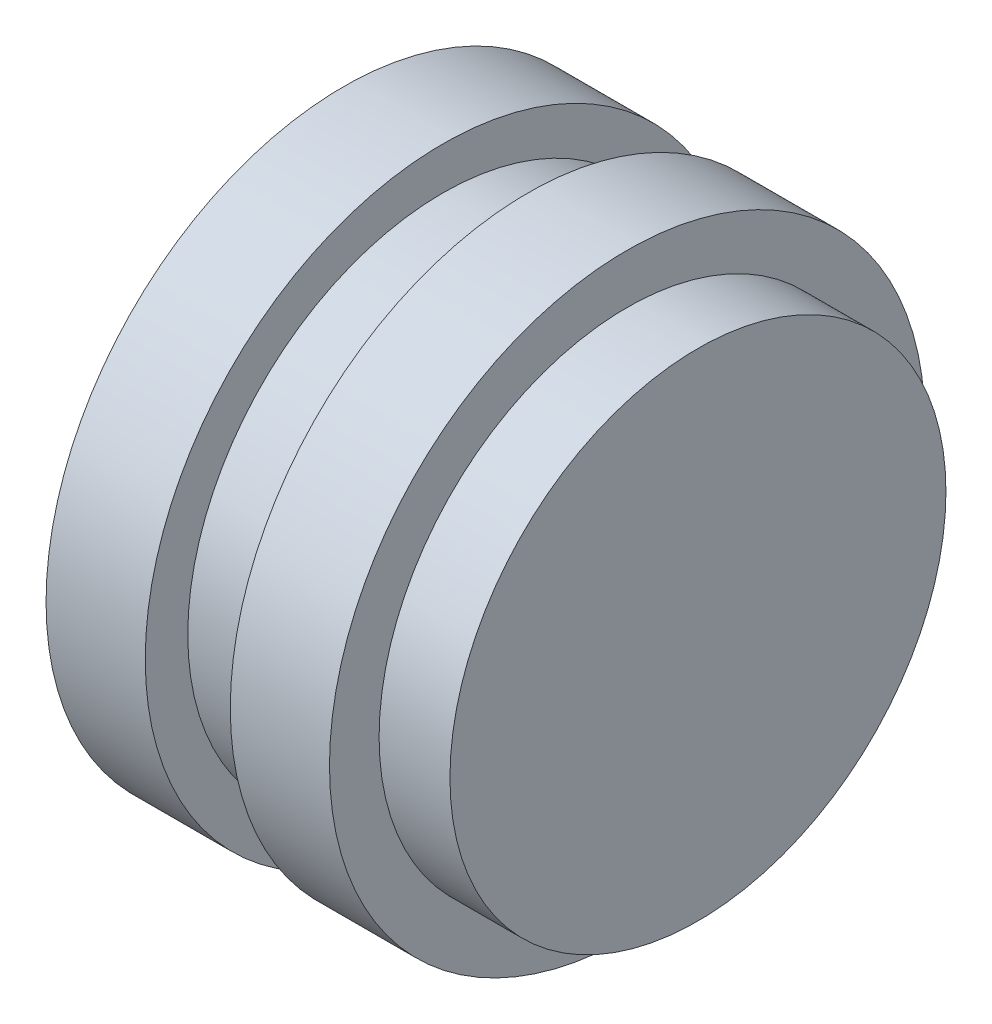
ISO-10303-21;
HEADER;
FILE_DESCRIPTION(('STEP AP214'),'2;1');
FILE_NAME('part.step','',(''),(''),'','','');
FILE_SCHEMA(('AUTOMOTIVE_DESIGN { 1 0 10303 214 1 1 1 1 }'));
ENDSEC;
DATA;
#1=APPLICATION_CONTEXT('core data for automotive mechanical design processes');
#2=APPLICATION_PROTOCOL_DEFINITION('international standard','automotive_design',2000,#1);
#3=PRODUCT_CONTEXT('',#1,'mechanical');
#4=PRODUCT('Part','Part','',(#3));
#5=PRODUCT_RELATED_PRODUCT_CATEGORY('part','',(#4));
#6=PRODUCT_DEFINITION_FORMATION('','',#4);
#7=PRODUCT_DEFINITION_CONTEXT('part definition',#1,'design');
#8=PRODUCT_DEFINITION('design','',#6,#7);
#9=PRODUCT_DEFINITION_SHAPE('','',#8);
#10=(LENGTH_UNIT() NAMED_UNIT(*) SI_UNIT(.MILLI.,.METRE.));
#11=(NAMED_UNIT(*) PLANE_ANGLE_UNIT() SI_UNIT($,.RADIAN.));
#12=(NAMED_UNIT(*) SI_UNIT($,.STERADIAN.) SOLID_ANGLE_UNIT());
#13=UNCERTAINTY_MEASURE_WITH_UNIT(LENGTH_MEASURE(1.E-05),#10,'distance_accuracy_value','');
#14=(GEOMETRIC_REPRESENTATION_CONTEXT(3) GLOBAL_UNCERTAINTY_ASSIGNED_CONTEXT((#13)) GLOBAL_UNIT_ASSIGNED_CONTEXT((#10,
#11,#12)) REPRESENTATION_CONTEXT('',''));
#15=CARTESIAN_POINT('',(0.,0.,0.));
#16=DIRECTION('',(0.,0.,1.));
#17=DIRECTION('',(1.,0.,0.));
#18=AXIS2_PLACEMENT_3D('',#15,#16,#17);
#19=CARTESIAN_POINT('',(11.5,0.,0.));
#20=DIRECTION('',(1.,0.,0.));
#21=DIRECTION('',(0.,0.,-1.));
#22=AXIS2_PLACEMENT_3D('',#19,#20,#21);
#23=PLANE('',#22);
#24=CARTESIAN_POINT('',(11.5,0.,0.));
#25=DIRECTION('',(1.,0.,0.));
#26=DIRECTION('',(0.,0.,-1.));
#27=AXIS2_PLACEMENT_3D('',#24,#25,#26);
#28=CIRCLE('',#27,17.5);
#29=CARTESIAN_POINT('',(11.5,0.,-17.5));
#30=VERTEX_POINT('',#29);
#31=EDGE_CURVE('E10',#30,#30,#28,.T.);
#32=ORIENTED_EDGE('',*,*,#31,.T.);
#33=EDGE_LOOP('',(#32));
#34=FACE_BOUND('',#33,.T.);
#35=ADVANCED_FACE('F35',(#34),#23,.T.);
#36=CARTESIAN_POINT('',(35.4425685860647,0.,0.));
#37=DIRECTION('',(1.,0.,0.));
#38=DIRECTION('',(0.,0.,-1.));
#39=AXIS2_PLACEMENT_3D('',#36,#37,#38);
#40=CYLINDRICAL_SURFACE('',#39,17.5);
#41=CARTESIAN_POINT('',(6.5,0.,0.));
#42=DIRECTION('',(1.,0.,0.));
#43=DIRECTION('',(0.,0.,-1.));
#44=AXIS2_PLACEMENT_3D('',#41,#42,#43);
#45=CIRCLE('',#44,17.5);
#46=CARTESIAN_POINT('',(6.5,0.,-17.5));
#47=VERTEX_POINT('',#46);
#48=EDGE_CURVE('E41',#47,#47,#45,.T.);
#49=ORIENTED_EDGE('',*,*,#48,.T.);
#50=EDGE_LOOP('',(#49));
#51=FACE_BOUND('',#50,.T.);
#52=ORIENTED_EDGE('',*,*,#31,.F.);
#53=EDGE_LOOP('',(#52));
#54=FACE_BOUND('',#53,.T.);
#55=ADVANCED_FACE('F79',(#51,#54),#40,.T.);
#56=CARTESIAN_POINT('',(6.5,21.,0.));
#57=DIRECTION('',(1.,0.,0.));
#58=DIRECTION('',(0.,0.,-1.));
#59=AXIS2_PLACEMENT_3D('',#56,#57,#58);
#60=PLANE('',#59);
#61=CARTESIAN_POINT('',(6.5,0.,0.));
#62=DIRECTION('',(1.,0.,0.));
#63=DIRECTION('',(0.,0.,-1.));
#64=AXIS2_PLACEMENT_3D('',#61,#62,#63);
#65=CIRCLE('',#64,21.);
#66=CARTESIAN_POINT('',(6.5,0.,-21.));
#67=VERTEX_POINT('',#66);
#68=EDGE_CURVE('E45',#67,#67,#65,.T.);
#69=ORIENTED_EDGE('',*,*,#68,.T.);
#70=EDGE_LOOP('',(#69));
#71=FACE_BOUND('',#70,.T.);
#72=ORIENTED_EDGE('',*,*,#48,.F.);
#73=EDGE_LOOP('',(#72));
#74=FACE_BOUND('',#73,.T.);
#75=ADVANCED_FACE('F83',(#71,#74),#60,.T.);
#76=CARTESIAN_POINT('',(35.4425685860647,0.,0.));
#77=DIRECTION('',(1.,0.,0.));
#78=DIRECTION('',(0.,0.,-1.));
#79=AXIS2_PLACEMENT_3D('',#76,#77,#78);
#80=CYLINDRICAL_SURFACE('',#79,21.);
#81=CARTESIAN_POINT('',(-0.5,0.,0.));
#82=DIRECTION('',(1.,0.,0.));
#83=DIRECTION('',(0.,0.,-1.));
#84=AXIS2_PLACEMENT_3D('',#81,#82,#83);
#85=CIRCLE('',#84,21.);
#86=CARTESIAN_POINT('',(-0.5,0.,-21.));
#87=VERTEX_POINT('',#86);
#88=EDGE_CURVE('E49',#87,#87,#85,.T.);
#89=ORIENTED_EDGE('',*,*,#88,.T.);
#90=EDGE_LOOP('',(#89));
#91=FACE_BOUND('',#90,.T.);
#92=ORIENTED_EDGE('',*,*,#68,.F.);
#93=EDGE_LOOP('',(#92));
#94=FACE_BOUND('',#93,.T.);
#95=ADVANCED_FACE('F87',(#91,#94),#80,.T.);
#96=CARTESIAN_POINT('',(-0.500000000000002,21.,0.));
#97=DIRECTION('',(-1.,0.,0.));
#98=DIRECTION('',(0.,0.,1.));
#99=AXIS2_PLACEMENT_3D('',#96,#97,#98);
#100=PLANE('',#99);
#101=CARTESIAN_POINT('',(-0.5,0.,0.));
#102=DIRECTION('',(1.,0.,0.));
#103=DIRECTION('',(0.,0.,-1.));
#104=AXIS2_PLACEMENT_3D('',#101,#102,#103);
#105=CIRCLE('',#104,18.);
#106=CARTESIAN_POINT('',(-0.5,0.,-18.));
#107=VERTEX_POINT('',#106);
#108=EDGE_CURVE('E54',#107,#107,#105,.T.);
#109=ORIENTED_EDGE('',*,*,#108,.T.);
#110=EDGE_LOOP('',(#109));
#111=FACE_BOUND('',#110,.T.);
#112=ORIENTED_EDGE('',*,*,#88,.F.);
#113=EDGE_LOOP('',(#112));
#114=FACE_BOUND('',#113,.T.);
#115=ADVANCED_FACE('F94',(#111,#114),#100,.T.);
#116=CARTESIAN_POINT('',(35.4425685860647,0.,0.));
#117=DIRECTION('',(1.,0.,0.));
#118=DIRECTION('',(0.,0.,-1.));
#119=AXIS2_PLACEMENT_3D('',#116,#117,#118);
#120=CYLINDRICAL_SURFACE('',#119,18.);
#121=CARTESIAN_POINT('',(-6.5,0.,0.));
#122=DIRECTION('',(1.,0.,0.));
#123=DIRECTION('',(0.,0.,-1.));
#124=AXIS2_PLACEMENT_3D('',#121,#122,#123);
#125=CIRCLE('',#124,18.);
#126=CARTESIAN_POINT('',(-6.5,0.,-18.));
#127=VERTEX_POINT('',#126);
#128=EDGE_CURVE('E57',#127,#127,#125,.T.);
#129=ORIENTED_EDGE('',*,*,#128,.T.);
#130=EDGE_LOOP('',(#129));
#131=FACE_BOUND('',#130,.T.);
#132=ORIENTED_EDGE('',*,*,#108,.F.);
#133=EDGE_LOOP('',(#132));
#134=FACE_BOUND('',#133,.T.);
#135=ADVANCED_FACE('F98',(#131,#134),#120,.T.);
#136=CARTESIAN_POINT('',(-6.5,18.,0.));
#137=DIRECTION('',(1.,0.,0.));
#138=DIRECTION('',(0.,0.,-1.));
#139=AXIS2_PLACEMENT_3D('',#136,#137,#138);
#140=PLANE('',#139);
#141=CARTESIAN_POINT('',(-6.5,0.,0.));
#142=DIRECTION('',(1.,0.,0.));
#143=DIRECTION('',(0.,0.,-1.));
#144=AXIS2_PLACEMENT_3D('',#141,#142,#143);
#145=CIRCLE('',#144,21.);
#146=CARTESIAN_POINT('',(-6.5,0.,-21.));
#147=VERTEX_POINT('',#146);
#148=EDGE_CURVE('E60',#147,#147,#145,.T.);
#149=ORIENTED_EDGE('',*,*,#148,.T.);
#150=EDGE_LOOP('',(#149));
#151=FACE_BOUND('',#150,.T.);
#152=ORIENTED_EDGE('',*,*,#128,.F.);
#153=EDGE_LOOP('',(#152));
#154=FACE_BOUND('',#153,.T.);
#155=ADVANCED_FACE('F76',(#151,#154),#140,.T.);
#156=CARTESIAN_POINT('',(35.4425685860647,0.,0.));
#157=DIRECTION('',(1.,0.,0.));
#158=DIRECTION('',(0.,0.,-1.));
#159=AXIS2_PLACEMENT_3D('',#156,#157,#158);
#160=CYLINDRICAL_SURFACE('',#159,21.);
#161=CARTESIAN_POINT('',(-13.5,0.,0.));
#162=DIRECTION('',(1.,0.,0.));
#163=DIRECTION('',(0.,0.,-1.));
#164=AXIS2_PLACEMENT_3D('',#161,#162,#163);
#165=CIRCLE('',#164,21.);
#166=CARTESIAN_POINT('',(-13.5,0.,-21.));
#167=VERTEX_POINT('',#166);
#168=EDGE_CURVE('E63',#167,#167,#165,.T.);
#169=ORIENTED_EDGE('',*,*,#168,.T.);
#170=EDGE_LOOP('',(#169));
#171=FACE_BOUND('',#170,.T.);
#172=ORIENTED_EDGE('',*,*,#148,.F.);
#173=EDGE_LOOP('',(#172));
#174=FACE_BOUND('',#173,.T.);
#175=ADVANCED_FACE('F67',(#171,#174),#160,.T.);
#176=CARTESIAN_POINT('',(-13.5,21.,0.));
#177=DIRECTION('',(-1.,0.,0.));
#178=DIRECTION('',(0.,0.,1.));
#179=AXIS2_PLACEMENT_3D('',#176,#177,#178);
#180=PLANE('',#179);
#181=ORIENTED_EDGE('',*,*,#168,.F.);
#182=EDGE_LOOP('',(#181));
#183=FACE_BOUND('',#182,.T.);
#184=ADVANCED_FACE('F70',(#183),#180,.T.);
#185=CLOSED_SHELL('',(#35,#55,#75,#95,#115,#135,#155,#175,#184));
#186=MANIFOLD_SOLID_BREP('B2',#185);
#187=ADVANCED_BREP_SHAPE_REPRESENTATION('',(#18,#186),#14);
#188=SHAPE_DEFINITION_REPRESENTATION(#9,#187);
ENDSEC;
END-ISO-10303-21;
